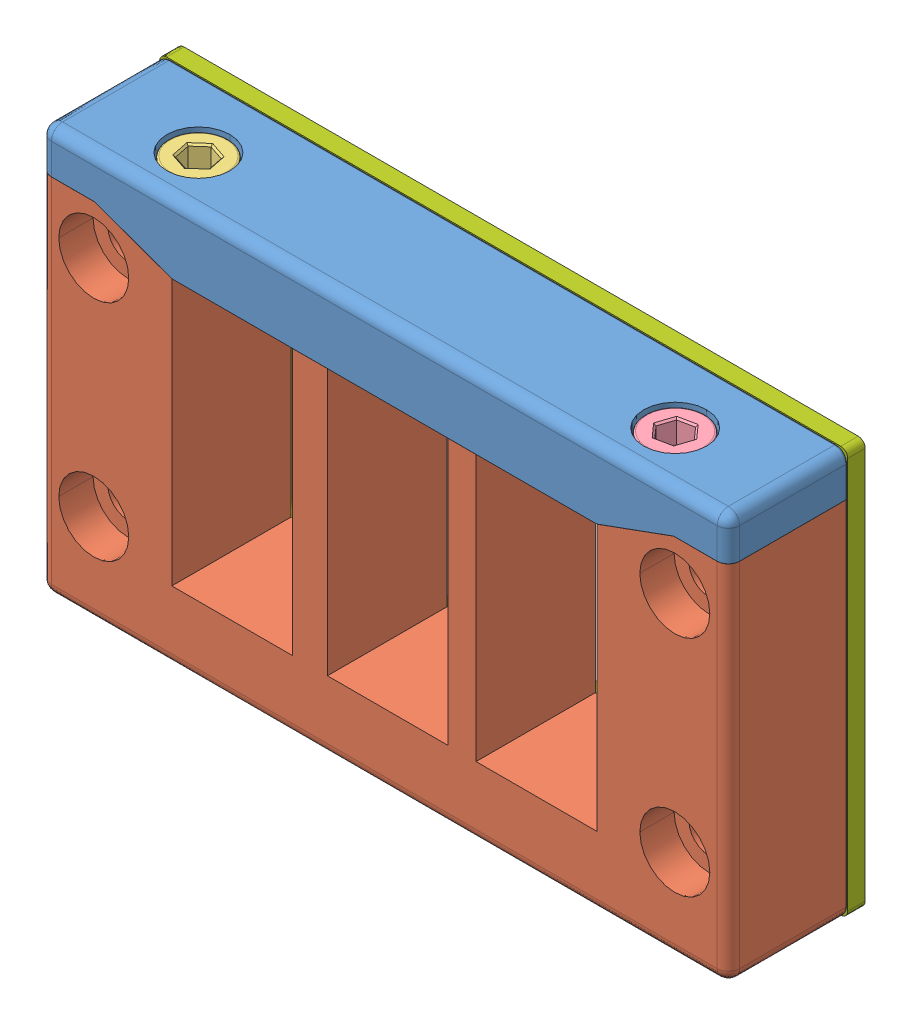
SolidWorks assembly 54216_200.SLDASM, configuration Default (file format 8000). Lengths in mm.
Overall size (98.3 58 19.55).
7 component instances, 7 part files, 0 mates.
Components (placement in the parent):
- 54216_200_01-1: 54216_200_01.SLDPRT [Default] at origin size (98.3 10 17.05)
- 54216_200_02-1: 54216_200_02.SLDPRT [Default] at origin size (98.3 52 17.05)
- 54216_200_03-1: 54216_200_03.SLDPRT [Default] at origin size (8.5 57 8.5)
- 54216_200_04-1: 54216_200_04.SLDPRT [Default] at origin size (8.5 57 8.5)
- 54216_200_05-1: 54216_200_05.SLDPRT [Default] at origin size (9.25 4.7 8.01)
- 54216_200_06-1: 54216_200_06.SLDPRT [Default] at origin size (9.25 4.7 8.01)
- 54216_200_07-1: 54216_200_07.SLDPRT [Default] at origin size (98.3 58 2.5)
